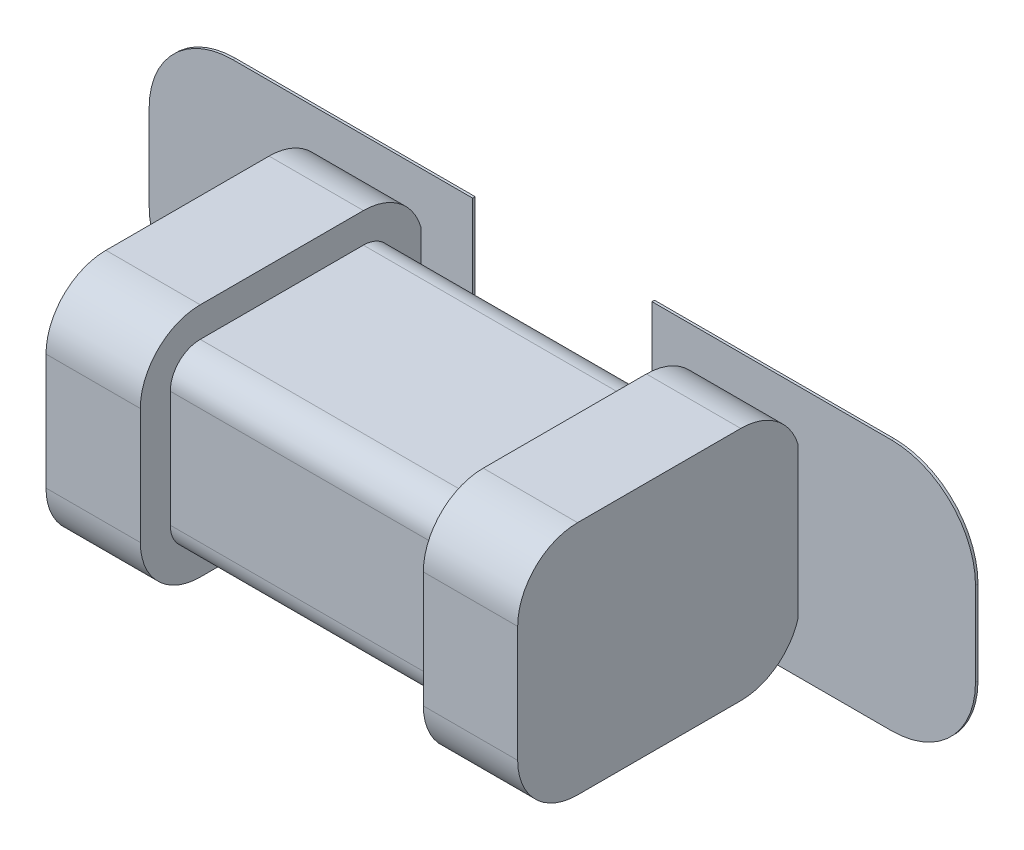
ISO-10303-21;
HEADER;
FILE_DESCRIPTION(('STEP AP214'),'2;1');
FILE_NAME('part.step','',(''),(''),'','','');
FILE_SCHEMA(('AUTOMOTIVE_DESIGN { 1 0 10303 214 1 1 1 1 }'));
ENDSEC;
DATA;
#1=APPLICATION_CONTEXT('core data for automotive mechanical design processes');
#2=APPLICATION_PROTOCOL_DEFINITION('international standard','automotive_design',2000,#1);
#3=PRODUCT_CONTEXT('',#1,'mechanical');
#4=PRODUCT('Part','Part','',(#3));
#5=PRODUCT_RELATED_PRODUCT_CATEGORY('part','',(#4));
#6=PRODUCT_DEFINITION_FORMATION('','',#4);
#7=PRODUCT_DEFINITION_CONTEXT('part definition',#1,'design');
#8=PRODUCT_DEFINITION('design','',#6,#7);
#9=PRODUCT_DEFINITION_SHAPE('','',#8);
#10=(LENGTH_UNIT() NAMED_UNIT(*) SI_UNIT(.MILLI.,.METRE.));
#11=(NAMED_UNIT(*) PLANE_ANGLE_UNIT() SI_UNIT($,.RADIAN.));
#12=(NAMED_UNIT(*) SI_UNIT($,.STERADIAN.) SOLID_ANGLE_UNIT());
#13=UNCERTAINTY_MEASURE_WITH_UNIT(LENGTH_MEASURE(1.E-05),#10,'distance_accuracy_value','');
#14=(GEOMETRIC_REPRESENTATION_CONTEXT(3) GLOBAL_UNCERTAINTY_ASSIGNED_CONTEXT((#13)) GLOBAL_UNIT_ASSIGNED_CONTEXT((#10,
#11,#12)) REPRESENTATION_CONTEXT('',''));
#15=CARTESIAN_POINT('',(0.,0.,0.));
#16=DIRECTION('',(0.,0.,1.));
#17=DIRECTION('',(1.,0.,0.));
#18=AXIS2_PLACEMENT_3D('',#15,#16,#17);
#19=CARTESIAN_POINT('',(0.,0.,0.0762));
#20=DIRECTION('',(0.,0.,1.));
#21=DIRECTION('',(1.,0.,0.));
#22=AXIS2_PLACEMENT_3D('',#19,#20,#21);
#23=PLANE('',#22);
#24=CARTESIAN_POINT('',(-0.698058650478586,-0.0890682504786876,0.0762));
#25=DIRECTION('',(0.,0.,1.));
#26=DIRECTION('',(1.,0.,0.));
#27=AXIS2_PLACEMENT_3D('',#24,#25,#26);
#28=CIRCLE('',#27,0.177936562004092);
#29=CARTESIAN_POINT('',(-0.875995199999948,-0.0890016,0.0762));
#30=VERTEX_POINT('',#29);
#31=CARTESIAN_POINT('',(-0.697992,-0.267004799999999,0.0762));
#32=VERTEX_POINT('',#31);
#33=EDGE_CURVE('E268',#30,#32,#28,.T.);
#34=ORIENTED_EDGE('',*,*,#33,.F.);
#35=DIRECTION('',(0.,1.,0.));
#36=VECTOR('',#35,1.);
#37=CARTESIAN_POINT('',(-0.8759952,0.0890016,0.0762));
#38=LINE('',#37,#36);
#39=CARTESIAN_POINT('',(-0.875995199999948,0.0890016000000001,0.0762));
#40=VERTEX_POINT('',#39);
#41=EDGE_CURVE('E262',#40,#30,#38,.F.);
#42=ORIENTED_EDGE('',*,*,#41,.F.);
#43=CARTESIAN_POINT('',(-0.698058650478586,0.0890682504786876,0.0762));
#44=DIRECTION('',(0.,0.,1.));
#45=DIRECTION('',(1.,0.,0.));
#46=AXIS2_PLACEMENT_3D('',#43,#44,#45);
#47=CIRCLE('',#46,0.177936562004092);
#48=CARTESIAN_POINT('',(-0.697992,0.267004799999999,0.0762));
#49=VERTEX_POINT('',#48);
#50=EDGE_CURVE('E19',#49,#40,#47,.T.);
#51=ORIENTED_EDGE('',*,*,#50,.F.);
#52=DIRECTION('',(1.,0.,0.));
#53=VECTOR('',#52,1.);
#54=CARTESIAN_POINT('',(-0.189992,0.2670048,0.0762));
#55=LINE('',#54,#53);
#56=CARTESIAN_POINT('',(-0.189992,0.2670048,0.0762));
#57=VERTEX_POINT('',#56);
#58=EDGE_CURVE('E245',#57,#49,#55,.F.);
#59=ORIENTED_EDGE('',*,*,#58,.F.);
#60=DIRECTION('',(0.,1.,0.));
#61=VECTOR('',#60,1.);
#62=CARTESIAN_POINT('',(-0.189992,-0.2670048,0.0762));
#63=LINE('',#62,#61);
#64=CARTESIAN_POINT('',(-0.189992,-0.2670048,0.0762));
#65=VERTEX_POINT('',#64);
#66=EDGE_CURVE('E408',#65,#57,#63,.T.);
#67=ORIENTED_EDGE('',*,*,#66,.F.);
#68=DIRECTION('',(1.,0.,0.));
#69=VECTOR('',#68,1.);
#70=CARTESIAN_POINT('',(-0.697992,-0.2670048,0.0762));
#71=LINE('',#70,#69);
#72=EDGE_CURVE('E395',#32,#65,#71,.T.);
#73=ORIENTED_EDGE('',*,*,#72,.F.);
#74=EDGE_LOOP('',(#34,#42,#51,#59,#67,#73));
#75=FACE_BOUND('',#74,.T.);
#76=ADVANCED_FACE('F16',(#75),#23,.F.);
#77=CARTESIAN_POINT('',(-0.189992,0.2670048,0.0762));
#78=DIRECTION('',(0.,1.,0.));
#79=DIRECTION('',(0.,0.,1.));
#80=AXIS2_PLACEMENT_3D('',#77,#78,#79);
#81=PLANE('',#80);
#82=DIRECTION('',(0.,0.,-1.));
#83=VECTOR('',#82,1.);
#84=CARTESIAN_POINT('',(-0.189992,0.2670048,0.0762));
#85=LINE('',#84,#83);
#86=CARTESIAN_POINT('',(-0.189992,0.2670048,0.081534));
#87=VERTEX_POINT('',#86);
#88=EDGE_CURVE('E399',#57,#87,#85,.F.);
#89=ORIENTED_EDGE('',*,*,#88,.F.);
#90=ORIENTED_EDGE('',*,*,#58,.T.);
#91=DIRECTION('',(0.,0.,1.));
#92=VECTOR('',#91,1.);
#93=CARTESIAN_POINT('',(-0.697992,0.267004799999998,0.0762));
#94=LINE('',#93,#92);
#95=CARTESIAN_POINT('',(-0.697992,0.267004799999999,0.081534));
#96=VERTEX_POINT('',#95);
#97=EDGE_CURVE('E256',#96,#49,#94,.F.);
#98=ORIENTED_EDGE('',*,*,#97,.F.);
#99=DIRECTION('',(1.,0.,0.));
#100=VECTOR('',#99,1.);
#101=CARTESIAN_POINT('',(0.,0.2670048,0.081534));
#102=LINE('',#101,#100);
#103=EDGE_CURVE('E390',#87,#96,#102,.F.);
#104=ORIENTED_EDGE('',*,*,#103,.F.);
#105=EDGE_LOOP('',(#89,#90,#98,#104));
#106=FACE_BOUND('',#105,.T.);
#107=ADVANCED_FACE('F457',(#106),#81,.T.);
#108=CARTESIAN_POINT('',(-0.698058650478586,0.0890682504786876,0.0762));
#109=DIRECTION('',(0.,0.,1.));
#110=DIRECTION('',(1.,0.,0.));
#111=AXIS2_PLACEMENT_3D('',#108,#109,#110);
#112=CYLINDRICAL_SURFACE('',#111,0.177936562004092);
#113=ORIENTED_EDGE('',*,*,#97,.T.);
#114=ORIENTED_EDGE('',*,*,#50,.T.);
#115=DIRECTION('',(0.,0.,1.));
#116=VECTOR('',#115,1.);
#117=CARTESIAN_POINT('',(-0.8759952,0.0890016,0.0762));
#118=LINE('',#117,#116);
#119=CARTESIAN_POINT('',(-0.875995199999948,0.0890016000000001,0.081534));
#120=VERTEX_POINT('',#119);
#121=EDGE_CURVE('E254',#120,#40,#118,.F.);
#122=ORIENTED_EDGE('',*,*,#121,.F.);
#123=CARTESIAN_POINT('',(-0.698058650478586,0.0890682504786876,0.081534));
#124=DIRECTION('',(0.,0.,1.));
#125=DIRECTION('',(1.,0.,0.));
#126=AXIS2_PLACEMENT_3D('',#123,#124,#125);
#127=CIRCLE('',#126,0.177936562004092);
#128=EDGE_CURVE('E389',#96,#120,#127,.T.);
#129=ORIENTED_EDGE('',*,*,#128,.F.);
#130=EDGE_LOOP('',(#113,#114,#122,#129));
#131=FACE_BOUND('',#130,.T.);
#132=ADVANCED_FACE('F252',(#131),#112,.T.);
#133=CARTESIAN_POINT('',(-0.8759952,0.0890016,0.0762));
#134=DIRECTION('',(-1.,0.,0.));
#135=DIRECTION('',(0.,0.,1.));
#136=AXIS2_PLACEMENT_3D('',#133,#134,#135);
#137=PLANE('',#136);
#138=ORIENTED_EDGE('',*,*,#121,.T.);
#139=ORIENTED_EDGE('',*,*,#41,.T.);
#140=DIRECTION('',(0.,0.,1.));
#141=VECTOR('',#140,1.);
#142=CARTESIAN_POINT('',(-0.875995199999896,-0.0890016,0.0762));
#143=LINE('',#142,#141);
#144=CARTESIAN_POINT('',(-0.875995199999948,-0.0890016,0.081534));
#145=VERTEX_POINT('',#144);
#146=EDGE_CURVE('E269',#145,#30,#143,.F.);
#147=ORIENTED_EDGE('',*,*,#146,.F.);
#148=DIRECTION('',(0.,1.,0.));
#149=VECTOR('',#148,1.);
#150=CARTESIAN_POINT('',(-0.8759952,0.,0.081534));
#151=LINE('',#150,#149);
#152=EDGE_CURVE('E264',#120,#145,#151,.F.);
#153=ORIENTED_EDGE('',*,*,#152,.F.);
#154=EDGE_LOOP('',(#138,#139,#147,#153));
#155=FACE_BOUND('',#154,.T.);
#156=ADVANCED_FACE('F260',(#155),#137,.T.);
#157=CARTESIAN_POINT('',(-0.698058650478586,-0.0890682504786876,0.0762));
#158=DIRECTION('',(0.,0.,1.));
#159=DIRECTION('',(1.,0.,0.));
#160=AXIS2_PLACEMENT_3D('',#157,#158,#159);
#161=CYLINDRICAL_SURFACE('',#160,0.177936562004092);
#162=ORIENTED_EDGE('',*,*,#146,.T.);
#163=ORIENTED_EDGE('',*,*,#33,.T.);
#164=DIRECTION('',(0.,0.,-1.));
#165=VECTOR('',#164,1.);
#166=CARTESIAN_POINT('',(-0.697992,-0.2670048,0.0762));
#167=LINE('',#166,#165);
#168=CARTESIAN_POINT('',(-0.697992,-0.267004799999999,0.081534));
#169=VERTEX_POINT('',#168);
#170=EDGE_CURVE('E391',#169,#32,#167,.T.);
#171=ORIENTED_EDGE('',*,*,#170,.F.);
#172=CARTESIAN_POINT('',(-0.698058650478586,-0.0890682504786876,0.081534));
#173=DIRECTION('',(0.,0.,1.));
#174=DIRECTION('',(1.,0.,0.));
#175=AXIS2_PLACEMENT_3D('',#172,#173,#174);
#176=CIRCLE('',#175,0.177936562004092);
#177=EDGE_CURVE('E386',#145,#169,#176,.T.);
#178=ORIENTED_EDGE('',*,*,#177,.F.);
#179=EDGE_LOOP('',(#162,#163,#171,#178));
#180=FACE_BOUND('',#179,.T.);
#181=ADVANCED_FACE('F458',(#180),#161,.T.);
#182=CARTESIAN_POINT('',(-0.697992,-0.2670048,0.0762));
#183=DIRECTION('',(0.,-1.,0.));
#184=DIRECTION('',(0.,0.,-1.));
#185=AXIS2_PLACEMENT_3D('',#182,#183,#184);
#186=PLANE('',#185);
#187=ORIENTED_EDGE('',*,*,#170,.T.);
#188=ORIENTED_EDGE('',*,*,#72,.T.);
#189=DIRECTION('',(0.,0.,-1.));
#190=VECTOR('',#189,1.);
#191=CARTESIAN_POINT('',(-0.189992,-0.2670048,0.0762));
#192=LINE('',#191,#190);
#193=CARTESIAN_POINT('',(-0.189992,-0.2670048,0.081534));
#194=VERTEX_POINT('',#193);
#195=EDGE_CURVE('E405',#194,#65,#192,.T.);
#196=ORIENTED_EDGE('',*,*,#195,.F.);
#197=DIRECTION('',(1.,0.,0.));
#198=VECTOR('',#197,1.);
#199=CARTESIAN_POINT('',(0.,-0.2670048,0.081534));
#200=LINE('',#199,#198);
#201=EDGE_CURVE('E388',#169,#194,#200,.T.);
#202=ORIENTED_EDGE('',*,*,#201,.F.);
#203=EDGE_LOOP('',(#187,#188,#196,#202));
#204=FACE_BOUND('',#203,.T.);
#205=ADVANCED_FACE('F455',(#204),#186,.T.);
#206=CARTESIAN_POINT('',(-0.189992,-0.2670048,0.0762));
#207=DIRECTION('',(1.,0.,0.));
#208=DIRECTION('',(0.,0.,-1.));
#209=AXIS2_PLACEMENT_3D('',#206,#207,#208);
#210=PLANE('',#209);
#211=ORIENTED_EDGE('',*,*,#195,.T.);
#212=ORIENTED_EDGE('',*,*,#66,.T.);
#213=ORIENTED_EDGE('',*,*,#88,.T.);
#214=DIRECTION('',(0.,1.,0.));
#215=VECTOR('',#214,1.);
#216=CARTESIAN_POINT('',(-0.189992,0.,0.081534));
#217=LINE('',#216,#215);
#218=EDGE_CURVE('E411',#194,#87,#217,.T.);
#219=ORIENTED_EDGE('',*,*,#218,.F.);
#220=EDGE_LOOP('',(#211,#212,#213,#219));
#221=FACE_BOUND('',#220,.T.);
#222=ADVANCED_FACE('F456',(#221),#210,.T.);
#223=CARTESIAN_POINT('',(-0.500000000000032,0.249999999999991,0.0762));
#224=DIRECTION('',(-1.,0.,0.));
#225=DIRECTION('',(0.,0.,1.));
#226=AXIS2_PLACEMENT_3D('',#223,#224,#225);
#227=PLANE('',#226);
#228=CARTESIAN_POINT('',(-0.500000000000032,0.122999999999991,0.2032));
#229=DIRECTION('',(1.,0.,0.));
#230=DIRECTION('',(0.,0.,-1.));
#231=AXIS2_PLACEMENT_3D('',#228,#229,#230);
#232=CIRCLE('',#231,0.127);
#233=CARTESIAN_POINT('',(-0.500000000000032,0.15941956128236,0.0815340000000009));
#234=VERTEX_POINT('',#233);
#235=CARTESIAN_POINT('',(-0.500000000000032,0.249999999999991,0.2032));
#236=VERTEX_POINT('',#235);
#237=EDGE_CURVE('E369',#234,#236,#232,.T.);
#238=ORIENTED_EDGE('',*,*,#237,.F.);
#239=DIRECTION('',(0.,1.,0.));
#240=VECTOR('',#239,1.);
#241=CARTESIAN_POINT('',(-0.500000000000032,0.,0.081534));
#242=LINE('',#241,#240);
#243=CARTESIAN_POINT('',(-0.500000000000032,-0.15941956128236,0.0815340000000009));
#244=VERTEX_POINT('',#243);
#245=EDGE_CURVE('E385',#244,#234,#242,.T.);
#246=ORIENTED_EDGE('',*,*,#245,.F.);
#247=CARTESIAN_POINT('',(-0.500000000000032,-0.122999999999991,0.2032));
#248=DIRECTION('',(1.,0.,0.));
#249=DIRECTION('',(0.,0.,-1.));
#250=AXIS2_PLACEMENT_3D('',#247,#248,#249);
#251=CIRCLE('',#250,0.127);
#252=CARTESIAN_POINT('',(-0.500000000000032,-0.249999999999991,0.2032));
#253=VERTEX_POINT('',#252);
#254=EDGE_CURVE('E382',#253,#244,#251,.T.);
#255=ORIENTED_EDGE('',*,*,#254,.F.);
#256=DIRECTION('',(0.,0.,-1.));
#257=VECTOR('',#256,1.);
#258=CARTESIAN_POINT('',(-0.500000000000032,-0.249999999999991,0.0762));
#259=LINE('',#258,#257);
#260=CARTESIAN_POINT('',(-0.500000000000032,-0.249999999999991,0.549148));
#261=VERTEX_POINT('',#260);
#262=EDGE_CURVE('E403',#261,#253,#259,.T.);
#263=ORIENTED_EDGE('',*,*,#262,.F.);
#264=CARTESIAN_POINT('',(-0.500000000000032,-0.122999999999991,0.549148));
#265=DIRECTION('',(1.,0.,0.));
#266=DIRECTION('',(0.,0.,-1.));
#267=AXIS2_PLACEMENT_3D('',#264,#265,#266);
#268=CIRCLE('',#267,0.127);
#269=CARTESIAN_POINT('',(-0.500000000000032,-0.122999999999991,0.676148));
#270=VERTEX_POINT('',#269);
#271=EDGE_CURVE('E378',#270,#261,#268,.T.);
#272=ORIENTED_EDGE('',*,*,#271,.F.);
#273=DIRECTION('',(0.,1.,0.));
#274=VECTOR('',#273,1.);
#275=CARTESIAN_POINT('',(-0.500000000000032,0.,0.676148));
#276=LINE('',#275,#274);
#277=CARTESIAN_POINT('',(-0.500000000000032,0.122999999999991,0.676148));
#278=VERTEX_POINT('',#277);
#279=EDGE_CURVE('E436',#278,#270,#276,.F.);
#280=ORIENTED_EDGE('',*,*,#279,.F.);
#281=CARTESIAN_POINT('',(-0.500000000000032,0.122999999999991,0.549148));
#282=DIRECTION('',(-1.,0.,0.));
#283=DIRECTION('',(0.,0.,1.));
#284=AXIS2_PLACEMENT_3D('',#281,#282,#283);
#285=CIRCLE('',#284,0.127);
#286=CARTESIAN_POINT('',(-0.500000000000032,0.249999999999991,0.549148));
#287=VERTEX_POINT('',#286);
#288=EDGE_CURVE('E373',#287,#278,#285,.F.);
#289=ORIENTED_EDGE('',*,*,#288,.F.);
#290=DIRECTION('',(0.,0.,1.));
#291=VECTOR('',#290,1.);
#292=CARTESIAN_POINT('',(-0.500000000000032,0.249999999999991,0.0762));
#293=LINE('',#292,#291);
#294=EDGE_CURVE('E376',#236,#287,#293,.T.);
#295=ORIENTED_EDGE('',*,*,#294,.F.);
#296=EDGE_LOOP('',(#238,#246,#255,#263,#272,#280,#289,#295));
#297=FACE_BOUND('',#296,.T.);
#298=ADVANCED_FACE('F603',(#297),#227,.T.);
#299=CARTESIAN_POINT('',(0.,0.,0.081534));
#300=DIRECTION('',(0.,0.,1.));
#301=DIRECTION('',(1.,0.,0.));
#302=AXIS2_PLACEMENT_3D('',#299,#300,#301);
#303=PLANE('',#302);
#304=DIRECTION('',(1.,0.,0.));
#305=VECTOR('',#304,1.);
#306=CARTESIAN_POINT('',(0.500000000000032,-0.159419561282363,0.0815340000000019));
#307=LINE('',#306,#305);
#308=CARTESIAN_POINT('',(-0.30000000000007,-0.15941956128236,0.0815340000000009));
#309=VERTEX_POINT('',#308);
#310=EDGE_CURVE('E384',#244,#309,#307,.T.);
#311=ORIENTED_EDGE('',*,*,#310,.F.);
#312=ORIENTED_EDGE('',*,*,#245,.T.);
#313=DIRECTION('',(1.,0.,0.));
#314=VECTOR('',#313,1.);
#315=CARTESIAN_POINT('',(0.500000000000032,0.159419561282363,0.0815340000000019));
#316=LINE('',#315,#314);
#317=CARTESIAN_POINT('',(-0.30000000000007,0.15941956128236,0.0815340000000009));
#318=VERTEX_POINT('',#317);
#319=EDGE_CURVE('E950',#318,#234,#316,.F.);
#320=ORIENTED_EDGE('',*,*,#319,.F.);
#321=DIRECTION('',(0.,1.,0.));
#322=VECTOR('',#321,1.);
#323=CARTESIAN_POINT('',(-0.30000000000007,0.249999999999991,0.081534));
#324=LINE('',#323,#322);
#325=EDGE_CURVE('E368',#318,#309,#324,.F.);
#326=ORIENTED_EDGE('',*,*,#325,.T.);
#327=EDGE_LOOP('',(#311,#312,#320,#326));
#328=FACE_BOUND('',#327,.T.);
#329=ORIENTED_EDGE('',*,*,#201,.T.);
#330=ORIENTED_EDGE('',*,*,#218,.T.);
#331=ORIENTED_EDGE('',*,*,#103,.T.);
#332=ORIENTED_EDGE('',*,*,#128,.T.);
#333=ORIENTED_EDGE('',*,*,#152,.T.);
#334=ORIENTED_EDGE('',*,*,#177,.T.);
#335=EDGE_LOOP('',(#329,#330,#331,#332,#333,#334));
#336=FACE_BOUND('',#335,.T.);
#337=ADVANCED_FACE('F452',(#328,#336),#303,.T.);
#338=CARTESIAN_POINT('',(0.500000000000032,-0.122999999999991,0.2032));
#339=DIRECTION('',(1.,0.,0.));
#340=DIRECTION('',(0.,0.,-1.));
#341=AXIS2_PLACEMENT_3D('',#338,#339,#340);
#342=CYLINDRICAL_SURFACE('',#341,0.127);
#343=ORIENTED_EDGE('',*,*,#254,.T.);
#344=ORIENTED_EDGE('',*,*,#310,.T.);
#345=CARTESIAN_POINT('',(-0.30000000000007,-0.122999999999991,0.2032));
#346=DIRECTION('',(1.,0.,0.));
#347=DIRECTION('',(0.,0.,-1.));
#348=AXIS2_PLACEMENT_3D('',#345,#346,#347);
#349=CIRCLE('',#348,0.127);
#350=CARTESIAN_POINT('',(-0.30000000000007,-0.249999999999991,0.2032));
#351=VERTEX_POINT('',#350);
#352=EDGE_CURVE('E365',#309,#351,#349,.F.);
#353=ORIENTED_EDGE('',*,*,#352,.T.);
#354=DIRECTION('',(1.,0.,0.));
#355=VECTOR('',#354,1.);
#356=CARTESIAN_POINT('',(-0.500000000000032,-0.249999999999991,0.2032));
#357=LINE('',#356,#355);
#358=EDGE_CURVE('E381',#253,#351,#357,.T.);
#359=ORIENTED_EDGE('',*,*,#358,.F.);
#360=EDGE_LOOP('',(#343,#344,#353,#359));
#361=FACE_BOUND('',#360,.T.);
#362=ADVANCED_FACE('F596',(#361),#342,.T.);
#363=CARTESIAN_POINT('',(-0.500000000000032,-0.249999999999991,0.0762));
#364=DIRECTION('',(0.,-1.,0.));
#365=DIRECTION('',(0.,0.,-1.));
#366=AXIS2_PLACEMENT_3D('',#363,#364,#365);
#367=PLANE('',#366);
#368=ORIENTED_EDGE('',*,*,#262,.T.);
#369=ORIENTED_EDGE('',*,*,#358,.T.);
#370=DIRECTION('',(0.,0.,1.));
#371=VECTOR('',#370,1.);
#372=CARTESIAN_POINT('',(-0.30000000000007,-0.249999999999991,0.0762));
#373=LINE('',#372,#371);
#374=CARTESIAN_POINT('',(-0.30000000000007,-0.249999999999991,0.549148));
#375=VERTEX_POINT('',#374);
#376=EDGE_CURVE('E364',#351,#375,#373,.T.);
#377=ORIENTED_EDGE('',*,*,#376,.T.);
#378=DIRECTION('',(1.,0.,0.));
#379=VECTOR('',#378,1.);
#380=CARTESIAN_POINT('',(-0.503692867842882,-0.249999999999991,0.549148));
#381=LINE('',#380,#379);
#382=EDGE_CURVE('E380',#261,#375,#381,.T.);
#383=ORIENTED_EDGE('',*,*,#382,.F.);
#384=EDGE_LOOP('',(#368,#369,#377,#383));
#385=FACE_BOUND('',#384,.T.);
#386=ADVANCED_FACE('F593',(#385),#367,.T.);
#387=CARTESIAN_POINT('',(-0.503692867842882,-0.122999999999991,0.549148));
#388=DIRECTION('',(1.,0.,0.));
#389=DIRECTION('',(0.,0.,-1.));
#390=AXIS2_PLACEMENT_3D('',#387,#388,#389);
#391=CYLINDRICAL_SURFACE('',#390,0.127);
#392=ORIENTED_EDGE('',*,*,#382,.T.);
#393=CARTESIAN_POINT('',(-0.30000000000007,-0.122999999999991,0.549148));
#394=DIRECTION('',(1.,0.,0.));
#395=DIRECTION('',(0.,0.,-1.));
#396=AXIS2_PLACEMENT_3D('',#393,#394,#395);
#397=CIRCLE('',#396,0.127);
#398=CARTESIAN_POINT('',(-0.30000000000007,-0.122999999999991,0.676148));
#399=VERTEX_POINT('',#398);
#400=EDGE_CURVE('E361',#375,#399,#397,.F.);
#401=ORIENTED_EDGE('',*,*,#400,.T.);
#402=DIRECTION('',(1.,0.,0.));
#403=VECTOR('',#402,1.);
#404=CARTESIAN_POINT('',(0.,-0.122999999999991,0.676148));
#405=LINE('',#404,#403);
#406=EDGE_CURVE('E437',#270,#399,#405,.T.);
#407=ORIENTED_EDGE('',*,*,#406,.F.);
#408=ORIENTED_EDGE('',*,*,#271,.T.);
#409=EDGE_LOOP('',(#392,#401,#407,#408));
#410=FACE_BOUND('',#409,.T.);
#411=ADVANCED_FACE('F590',(#410),#391,.T.);
#412=CARTESIAN_POINT('',(0.,0.,0.676148));
#413=DIRECTION('',(0.,0.,1.));
#414=DIRECTION('',(1.,0.,0.));
#415=AXIS2_PLACEMENT_3D('',#412,#413,#414);
#416=PLANE('',#415);
#417=DIRECTION('',(0.,1.,0.));
#418=VECTOR('',#417,1.);
#419=CARTESIAN_POINT('',(-0.30000000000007,0.249999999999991,0.676148));
#420=LINE('',#419,#418);
#421=CARTESIAN_POINT('',(-0.30000000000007,0.122999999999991,0.676148));
#422=VERTEX_POINT('',#421);
#423=EDGE_CURVE('E360',#399,#422,#420,.T.);
#424=ORIENTED_EDGE('',*,*,#423,.T.);
#425=DIRECTION('',(-1.,0.,0.));
#426=VECTOR('',#425,1.);
#427=CARTESIAN_POINT('',(0.503550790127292,0.122999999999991,0.676148));
#428=LINE('',#427,#426);
#429=EDGE_CURVE('E377',#278,#422,#428,.F.);
#430=ORIENTED_EDGE('',*,*,#429,.F.);
#431=ORIENTED_EDGE('',*,*,#279,.T.);
#432=ORIENTED_EDGE('',*,*,#406,.T.);
#433=EDGE_LOOP('',(#424,#430,#431,#432));
#434=FACE_BOUND('',#433,.T.);
#435=ADVANCED_FACE('F586',(#434),#416,.T.);
#436=CARTESIAN_POINT('',(0.503550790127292,0.122999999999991,0.549148));
#437=DIRECTION('',(-1.,0.,0.));
#438=DIRECTION('',(0.,0.,1.));
#439=AXIS2_PLACEMENT_3D('',#436,#437,#438);
#440=CYLINDRICAL_SURFACE('',#439,0.127);
#441=DIRECTION('',(1.,0.,0.));
#442=VECTOR('',#441,1.);
#443=CARTESIAN_POINT('',(0.500000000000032,0.249999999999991,0.549148));
#444=LINE('',#443,#442);
#445=CARTESIAN_POINT('',(-0.30000000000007,0.249999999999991,0.549148));
#446=VERTEX_POINT('',#445);
#447=EDGE_CURVE('E372',#287,#446,#444,.T.);
#448=ORIENTED_EDGE('',*,*,#447,.F.);
#449=ORIENTED_EDGE('',*,*,#288,.T.);
#450=ORIENTED_EDGE('',*,*,#429,.T.);
#451=CARTESIAN_POINT('',(-0.30000000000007,0.122999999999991,0.549148));
#452=DIRECTION('',(-1.,0.,0.));
#453=DIRECTION('',(0.,0.,1.));
#454=AXIS2_PLACEMENT_3D('',#451,#452,#453);
#455=CIRCLE('',#454,0.127);
#456=EDGE_CURVE('E357',#422,#446,#455,.T.);
#457=ORIENTED_EDGE('',*,*,#456,.T.);
#458=EDGE_LOOP('',(#448,#449,#450,#457));
#459=FACE_BOUND('',#458,.T.);
#460=ADVANCED_FACE('F582',(#459),#440,.T.);
#461=CARTESIAN_POINT('',(0.500000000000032,0.249999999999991,0.0762));
#462=DIRECTION('',(0.,1.,0.));
#463=DIRECTION('',(0.,0.,1.));
#464=AXIS2_PLACEMENT_3D('',#461,#462,#463);
#465=PLANE('',#464);
#466=DIRECTION('',(0.,0.,1.));
#467=VECTOR('',#466,1.);
#468=CARTESIAN_POINT('',(-0.30000000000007,0.249999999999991,0.0762));
#469=LINE('',#468,#467);
#470=CARTESIAN_POINT('',(-0.30000000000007,0.249999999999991,0.2032));
#471=VERTEX_POINT('',#470);
#472=EDGE_CURVE('E356',#446,#471,#469,.F.);
#473=ORIENTED_EDGE('',*,*,#472,.T.);
#474=DIRECTION('',(1.,0.,0.));
#475=VECTOR('',#474,1.);
#476=CARTESIAN_POINT('',(0.500000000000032,0.249999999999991,0.2032));
#477=LINE('',#476,#475);
#478=EDGE_CURVE('E371',#236,#471,#477,.T.);
#479=ORIENTED_EDGE('',*,*,#478,.F.);
#480=ORIENTED_EDGE('',*,*,#294,.T.);
#481=ORIENTED_EDGE('',*,*,#447,.T.);
#482=EDGE_LOOP('',(#473,#479,#480,#481));
#483=FACE_BOUND('',#482,.T.);
#484=ADVANCED_FACE('F578',(#483),#465,.T.);
#485=CARTESIAN_POINT('',(0.500000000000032,0.122999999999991,0.2032));
#486=DIRECTION('',(1.,0.,0.));
#487=DIRECTION('',(0.,0.,-1.));
#488=AXIS2_PLACEMENT_3D('',#485,#486,#487);
#489=CYLINDRICAL_SURFACE('',#488,0.127);
#490=CARTESIAN_POINT('',(-0.30000000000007,0.122999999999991,0.2032));
#491=DIRECTION('',(1.,0.,0.));
#492=DIRECTION('',(0.,0.,-1.));
#493=AXIS2_PLACEMENT_3D('',#490,#491,#492);
#494=CIRCLE('',#493,0.127);
#495=EDGE_CURVE('E353',#471,#318,#494,.F.);
#496=ORIENTED_EDGE('',*,*,#495,.T.);
#497=ORIENTED_EDGE('',*,*,#319,.T.);
#498=ORIENTED_EDGE('',*,*,#237,.T.);
#499=ORIENTED_EDGE('',*,*,#478,.T.);
#500=EDGE_LOOP('',(#496,#497,#498,#499));
#501=FACE_BOUND('',#500,.T.);
#502=ADVANCED_FACE('F574',(#501),#489,.T.);
#503=CARTESIAN_POINT('',(-0.30000000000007,0.249999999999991,0.0762));
#504=DIRECTION('',(-1.,0.,0.));
#505=DIRECTION('',(0.,0.,1.));
#506=AXIS2_PLACEMENT_3D('',#503,#504,#505);
#507=PLANE('',#506);
#508=DIRECTION('',(0.,1.,0.));
#509=VECTOR('',#508,1.);
#510=CARTESIAN_POINT('',(-0.30000000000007,0.249999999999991,0.1397));
#511=LINE('',#510,#509);
#512=CARTESIAN_POINT('',(-0.30000000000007,0.122999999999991,0.1397));
#513=VERTEX_POINT('',#512);
#514=CARTESIAN_POINT('',(-0.30000000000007,-0.122999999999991,0.1397));
#515=VERTEX_POINT('',#514);
#516=EDGE_CURVE('E344',#513,#515,#511,.F.);
#517=ORIENTED_EDGE('',*,*,#516,.T.);
#518=CARTESIAN_POINT('',(-0.30000000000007,-0.122999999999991,0.2032));
#519=DIRECTION('',(1.,0.,0.));
#520=DIRECTION('',(0.,0.,-1.));
#521=AXIS2_PLACEMENT_3D('',#518,#519,#520);
#522=CIRCLE('',#521,0.0635);
#523=CARTESIAN_POINT('',(-0.30000000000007,-0.186499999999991,0.2032));
#524=VERTEX_POINT('',#523);
#525=EDGE_CURVE('E341',#524,#515,#522,.T.);
#526=ORIENTED_EDGE('',*,*,#525,.F.);
#527=DIRECTION('',(0.,0.,1.));
#528=VECTOR('',#527,1.);
#529=CARTESIAN_POINT('',(-0.30000000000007,-0.186499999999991,0.0762));
#530=LINE('',#529,#528);
#531=CARTESIAN_POINT('',(-0.30000000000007,-0.186499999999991,0.549148));
#532=VERTEX_POINT('',#531);
#533=EDGE_CURVE('E340',#524,#532,#530,.T.);
#534=ORIENTED_EDGE('',*,*,#533,.T.);
#535=CARTESIAN_POINT('',(-0.30000000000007,-0.122999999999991,0.549148));
#536=DIRECTION('',(-1.,0.,0.));
#537=DIRECTION('',(0.,0.,1.));
#538=AXIS2_PLACEMENT_3D('',#535,#536,#537);
#539=CIRCLE('',#538,0.0635);
#540=CARTESIAN_POINT('',(-0.30000000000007,-0.122999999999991,0.612648));
#541=VERTEX_POINT('',#540);
#542=EDGE_CURVE('E337',#541,#532,#539,.F.);
#543=ORIENTED_EDGE('',*,*,#542,.F.);
#544=DIRECTION('',(0.,1.,0.));
#545=VECTOR('',#544,1.);
#546=CARTESIAN_POINT('',(-0.30000000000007,0.249999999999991,0.612648));
#547=LINE('',#546,#545);
#548=CARTESIAN_POINT('',(-0.30000000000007,0.122999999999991,0.612648));
#549=VERTEX_POINT('',#548);
#550=EDGE_CURVE('E352',#541,#549,#547,.T.);
#551=ORIENTED_EDGE('',*,*,#550,.T.);
#552=CARTESIAN_POINT('',(-0.30000000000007,0.122999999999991,0.549148));
#553=DIRECTION('',(1.,0.,0.));
#554=DIRECTION('',(0.,0.,-1.));
#555=AXIS2_PLACEMENT_3D('',#552,#553,#554);
#556=CIRCLE('',#555,0.0635);
#557=CARTESIAN_POINT('',(-0.30000000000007,0.186499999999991,0.549148));
#558=VERTEX_POINT('',#557);
#559=EDGE_CURVE('E349',#558,#549,#556,.T.);
#560=ORIENTED_EDGE('',*,*,#559,.F.);
#561=DIRECTION('',(0.,0.,-1.));
#562=VECTOR('',#561,1.);
#563=CARTESIAN_POINT('',(-0.30000000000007,0.186499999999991,0.0762));
#564=LINE('',#563,#562);
#565=CARTESIAN_POINT('',(-0.30000000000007,0.186499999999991,0.2032));
#566=VERTEX_POINT('',#565);
#567=EDGE_CURVE('E348',#558,#566,#564,.T.);
#568=ORIENTED_EDGE('',*,*,#567,.T.);
#569=CARTESIAN_POINT('',(-0.30000000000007,0.122999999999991,0.2032));
#570=DIRECTION('',(-1.,0.,0.));
#571=DIRECTION('',(0.,0.,1.));
#572=AXIS2_PLACEMENT_3D('',#569,#570,#571);
#573=CIRCLE('',#572,0.0635);
#574=EDGE_CURVE('E345',#513,#566,#573,.F.);
#575=ORIENTED_EDGE('',*,*,#574,.F.);
#576=EDGE_LOOP('',(#517,#526,#534,#543,#551,#560,#568,#575));
#577=FACE_BOUND('',#576,.T.);
#578=ORIENTED_EDGE('',*,*,#472,.F.);
#579=ORIENTED_EDGE('',*,*,#456,.F.);
#580=ORIENTED_EDGE('',*,*,#423,.F.);
#581=ORIENTED_EDGE('',*,*,#400,.F.);
#582=ORIENTED_EDGE('',*,*,#376,.F.);
#583=ORIENTED_EDGE('',*,*,#352,.F.);
#584=ORIENTED_EDGE('',*,*,#325,.F.);
#585=ORIENTED_EDGE('',*,*,#495,.F.);
#586=EDGE_LOOP('',(#578,#579,#580,#581,#582,#583,#584,#585));
#587=FACE_BOUND('',#586,.T.);
#588=ADVANCED_FACE('F570',(#577,#587),#507,.F.);
#589=CARTESIAN_POINT('',(0.30000000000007,0.249999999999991,0.612648));
#590=DIRECTION('',(0.,0.,-1.));
#591=DIRECTION('',(-1.,0.,0.));
#592=AXIS2_PLACEMENT_3D('',#589,#590,#591);
#593=PLANE('',#592);
#594=DIRECTION('',(-1.,0.,0.));
#595=VECTOR('',#594,1.);
#596=CARTESIAN_POINT('',(0.30369286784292,-0.122999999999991,0.612648));
#597=LINE('',#596,#595);
#598=CARTESIAN_POINT('',(0.30000000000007,-0.122999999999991,0.612648));
#599=VERTEX_POINT('',#598);
#600=EDGE_CURVE('E993',#599,#541,#597,.T.);
#601=ORIENTED_EDGE('',*,*,#600,.F.);
#602=DIRECTION('',(0.,1.,0.));
#603=VECTOR('',#602,1.);
#604=CARTESIAN_POINT('',(0.30000000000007,0.186499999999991,0.612648));
#605=LINE('',#604,#603);
#606=CARTESIAN_POINT('',(0.30000000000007,0.122999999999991,0.612648));
#607=VERTEX_POINT('',#606);
#608=EDGE_CURVE('E324',#599,#607,#605,.T.);
#609=ORIENTED_EDGE('',*,*,#608,.T.);
#610=DIRECTION('',(1.,0.,0.));
#611=VECTOR('',#610,1.);
#612=CARTESIAN_POINT('',(-0.303870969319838,0.122999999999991,0.612648));
#613=LINE('',#612,#611);
#614=EDGE_CURVE('E351',#549,#607,#613,.T.);
#615=ORIENTED_EDGE('',*,*,#614,.F.);
#616=ORIENTED_EDGE('',*,*,#550,.F.);
#617=EDGE_LOOP('',(#601,#609,#615,#616));
#618=FACE_BOUND('',#617,.T.);
#619=ADVANCED_FACE('F566',(#618),#593,.F.);
#620=CARTESIAN_POINT('',(-0.303870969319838,0.122999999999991,0.549148));
#621=DIRECTION('',(1.,0.,0.));
#622=DIRECTION('',(0.,0.,-1.));
#623=AXIS2_PLACEMENT_3D('',#620,#621,#622);
#624=CYLINDRICAL_SURFACE('',#623,0.0635);
#625=ORIENTED_EDGE('',*,*,#559,.T.);
#626=ORIENTED_EDGE('',*,*,#614,.T.);
#627=CARTESIAN_POINT('',(0.30000000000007,0.122999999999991,0.549148));
#628=DIRECTION('',(1.,0.,0.));
#629=DIRECTION('',(0.,0.,-1.));
#630=AXIS2_PLACEMENT_3D('',#627,#628,#629);
#631=CIRCLE('',#630,0.0635);
#632=CARTESIAN_POINT('',(0.30000000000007,0.186499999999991,0.549148));
#633=VERTEX_POINT('',#632);
#634=EDGE_CURVE('E321',#607,#633,#631,.F.);
#635=ORIENTED_EDGE('',*,*,#634,.T.);
#636=DIRECTION('',(1.,0.,0.));
#637=VECTOR('',#636,1.);
#638=CARTESIAN_POINT('',(-0.30000000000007,0.186499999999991,0.549148));
#639=LINE('',#638,#637);
#640=EDGE_CURVE('E974',#633,#558,#639,.F.);
#641=ORIENTED_EDGE('',*,*,#640,.T.);
#642=EDGE_LOOP('',(#625,#626,#635,#641));
#643=FACE_BOUND('',#642,.T.);
#644=ADVANCED_FACE('F562',(#643),#624,.T.);
#645=CARTESIAN_POINT('',(-0.30000000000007,0.186499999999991,0.0762));
#646=DIRECTION('',(0.,-1.,0.));
#647=DIRECTION('',(0.,0.,-1.));
#648=AXIS2_PLACEMENT_3D('',#645,#646,#647);
#649=PLANE('',#648);
#650=ORIENTED_EDGE('',*,*,#640,.F.);
#651=DIRECTION('',(0.,0.,-1.));
#652=VECTOR('',#651,1.);
#653=CARTESIAN_POINT('',(0.30000000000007,0.186499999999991,0.0762));
#654=LINE('',#653,#652);
#655=CARTESIAN_POINT('',(0.30000000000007,0.186499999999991,0.2032));
#656=VERTEX_POINT('',#655);
#657=EDGE_CURVE('E320',#633,#656,#654,.T.);
#658=ORIENTED_EDGE('',*,*,#657,.T.);
#659=DIRECTION('',(-1.,0.,0.));
#660=VECTOR('',#659,1.);
#661=CARTESIAN_POINT('',(0.30355079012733,0.186499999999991,0.2032));
#662=LINE('',#661,#660);
#663=EDGE_CURVE('E347',#566,#656,#662,.F.);
#664=ORIENTED_EDGE('',*,*,#663,.F.);
#665=ORIENTED_EDGE('',*,*,#567,.F.);
#666=EDGE_LOOP('',(#650,#658,#664,#665));
#667=FACE_BOUND('',#666,.T.);
#668=ADVANCED_FACE('F558',(#667),#649,.F.);
#669=CARTESIAN_POINT('',(0.30355079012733,0.122999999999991,0.2032));
#670=DIRECTION('',(-1.,0.,0.));
#671=DIRECTION('',(0.,0.,1.));
#672=AXIS2_PLACEMENT_3D('',#669,#670,#671);
#673=CYLINDRICAL_SURFACE('',#672,0.0635);
#674=CARTESIAN_POINT('',(0.30000000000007,0.122999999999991,0.2032));
#675=DIRECTION('',(-1.,0.,0.));
#676=DIRECTION('',(0.,0.,1.));
#677=AXIS2_PLACEMENT_3D('',#674,#675,#676);
#678=CIRCLE('',#677,0.0635);
#679=CARTESIAN_POINT('',(0.30000000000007,0.122999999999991,0.1397));
#680=VERTEX_POINT('',#679);
#681=EDGE_CURVE('E317',#656,#680,#678,.T.);
#682=ORIENTED_EDGE('',*,*,#681,.T.);
#683=DIRECTION('',(1.,0.,0.));
#684=VECTOR('',#683,1.);
#685=CARTESIAN_POINT('',(-0.30000000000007,0.122999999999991,0.1397));
#686=LINE('',#685,#684);
#687=EDGE_CURVE('E972',#680,#513,#686,.F.);
#688=ORIENTED_EDGE('',*,*,#687,.T.);
#689=ORIENTED_EDGE('',*,*,#574,.T.);
#690=ORIENTED_EDGE('',*,*,#663,.T.);
#691=EDGE_LOOP('',(#682,#688,#689,#690));
#692=FACE_BOUND('',#691,.T.);
#693=ADVANCED_FACE('F554',(#692),#673,.T.);
#694=CARTESIAN_POINT('',(-0.30000000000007,0.249999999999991,0.1397));
#695=DIRECTION('',(0.,0.,1.));
#696=DIRECTION('',(1.,0.,0.));
#697=AXIS2_PLACEMENT_3D('',#694,#695,#696);
#698=PLANE('',#697);
#699=DIRECTION('',(1.,0.,0.));
#700=VECTOR('',#699,1.);
#701=CARTESIAN_POINT('',(-0.30355079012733,-0.122999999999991,0.1397));
#702=LINE('',#701,#700);
#703=CARTESIAN_POINT('',(0.30000000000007,-0.122999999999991,0.1397));
#704=VERTEX_POINT('',#703);
#705=EDGE_CURVE('E343',#515,#704,#702,.T.);
#706=ORIENTED_EDGE('',*,*,#705,.F.);
#707=ORIENTED_EDGE('',*,*,#516,.F.);
#708=ORIENTED_EDGE('',*,*,#687,.F.);
#709=DIRECTION('',(0.,1.,0.));
#710=VECTOR('',#709,1.);
#711=CARTESIAN_POINT('',(0.30000000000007,0.186499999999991,0.1397));
#712=LINE('',#711,#710);
#713=EDGE_CURVE('E316',#680,#704,#712,.F.);
#714=ORIENTED_EDGE('',*,*,#713,.T.);
#715=EDGE_LOOP('',(#706,#707,#708,#714));
#716=FACE_BOUND('',#715,.T.);
#717=ADVANCED_FACE('F550',(#716),#698,.F.);
#718=CARTESIAN_POINT('',(-0.30355079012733,-0.122999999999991,0.2032));
#719=DIRECTION('',(1.,0.,0.));
#720=DIRECTION('',(0.,0.,-1.));
#721=AXIS2_PLACEMENT_3D('',#718,#719,#720);
#722=CYLINDRICAL_SURFACE('',#721,0.0635);
#723=ORIENTED_EDGE('',*,*,#525,.T.);
#724=ORIENTED_EDGE('',*,*,#705,.T.);
#725=CARTESIAN_POINT('',(0.30000000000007,-0.122999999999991,0.2032));
#726=DIRECTION('',(1.,0.,0.));
#727=DIRECTION('',(0.,0.,-1.));
#728=AXIS2_PLACEMENT_3D('',#725,#726,#727);
#729=CIRCLE('',#728,0.0635);
#730=CARTESIAN_POINT('',(0.30000000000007,-0.186499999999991,0.2032));
#731=VERTEX_POINT('',#730);
#732=EDGE_CURVE('E313',#704,#731,#729,.F.);
#733=ORIENTED_EDGE('',*,*,#732,.T.);
#734=DIRECTION('',(1.,0.,0.));
#735=VECTOR('',#734,1.);
#736=CARTESIAN_POINT('',(0.30000000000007,-0.186499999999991,0.2032));
#737=LINE('',#736,#735);
#738=EDGE_CURVE('E985',#731,#524,#737,.F.);
#739=ORIENTED_EDGE('',*,*,#738,.T.);
#740=EDGE_LOOP('',(#723,#724,#733,#739));
#741=FACE_BOUND('',#740,.T.);
#742=ADVANCED_FACE('F546',(#741),#722,.T.);
#743=CARTESIAN_POINT('',(0.30000000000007,-0.186499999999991,0.0762));
#744=DIRECTION('',(0.,1.,0.));
#745=DIRECTION('',(0.,0.,1.));
#746=AXIS2_PLACEMENT_3D('',#743,#744,#745);
#747=PLANE('',#746);
#748=ORIENTED_EDGE('',*,*,#738,.F.);
#749=DIRECTION('',(0.,0.,-1.));
#750=VECTOR('',#749,1.);
#751=CARTESIAN_POINT('',(0.30000000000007,-0.186499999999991,0.0762));
#752=LINE('',#751,#750);
#753=CARTESIAN_POINT('',(0.30000000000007,-0.186499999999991,0.549148));
#754=VERTEX_POINT('',#753);
#755=EDGE_CURVE('E312',#731,#754,#752,.F.);
#756=ORIENTED_EDGE('',*,*,#755,.T.);
#757=DIRECTION('',(-1.,0.,0.));
#758=VECTOR('',#757,1.);
#759=CARTESIAN_POINT('',(0.30369286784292,-0.186499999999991,0.549148));
#760=LINE('',#759,#758);
#761=EDGE_CURVE('E339',#532,#754,#760,.F.);
#762=ORIENTED_EDGE('',*,*,#761,.F.);
#763=ORIENTED_EDGE('',*,*,#533,.F.);
#764=EDGE_LOOP('',(#748,#756,#762,#763));
#765=FACE_BOUND('',#764,.T.);
#766=ADVANCED_FACE('F542',(#765),#747,.F.);
#767=CARTESIAN_POINT('',(0.30369286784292,-0.122999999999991,0.549148));
#768=DIRECTION('',(-1.,0.,0.));
#769=DIRECTION('',(0.,0.,1.));
#770=AXIS2_PLACEMENT_3D('',#767,#768,#769);
#771=CYLINDRICAL_SURFACE('',#770,0.0635);
#772=CARTESIAN_POINT('',(0.30000000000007,-0.122999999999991,0.549148));
#773=DIRECTION('',(-1.,0.,0.));
#774=DIRECTION('',(0.,0.,1.));
#775=AXIS2_PLACEMENT_3D('',#772,#773,#774);
#776=CIRCLE('',#775,0.0635);
#777=EDGE_CURVE('E309',#754,#599,#776,.T.);
#778=ORIENTED_EDGE('',*,*,#777,.T.);
#779=ORIENTED_EDGE('',*,*,#600,.T.);
#780=ORIENTED_EDGE('',*,*,#542,.T.);
#781=ORIENTED_EDGE('',*,*,#761,.T.);
#782=EDGE_LOOP('',(#778,#779,#780,#781));
#783=FACE_BOUND('',#782,.T.);
#784=ADVANCED_FACE('F538',(#783),#771,.T.);
#785=CARTESIAN_POINT('',(0.500000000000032,0.249999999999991,0.0762));
#786=DIRECTION('',(0.,1.,0.));
#787=DIRECTION('',(0.,0.,1.));
#788=AXIS2_PLACEMENT_3D('',#785,#786,#787);
#789=PLANE('',#788);
#790=DIRECTION('',(0.,0.,-1.));
#791=VECTOR('',#790,1.);
#792=CARTESIAN_POINT('',(0.500000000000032,0.249999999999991,0.0762));
#793=LINE('',#792,#791);
#794=CARTESIAN_POINT('',(0.500000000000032,0.249999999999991,0.2032));
#795=VERTEX_POINT('',#794);
#796=CARTESIAN_POINT('',(0.500000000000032,0.249999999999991,0.549148));
#797=VERTEX_POINT('',#796);
#798=EDGE_CURVE('E301',#795,#797,#793,.F.);
#799=ORIENTED_EDGE('',*,*,#798,.F.);
#800=DIRECTION('',(1.,0.,0.));
#801=VECTOR('',#800,1.);
#802=CARTESIAN_POINT('',(0.500000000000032,0.249999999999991,0.2032));
#803=LINE('',#802,#801);
#804=CARTESIAN_POINT('',(0.30000000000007,0.249999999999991,0.2032));
#805=VERTEX_POINT('',#804);
#806=EDGE_CURVE('E305',#805,#795,#803,.T.);
#807=ORIENTED_EDGE('',*,*,#806,.F.);
#808=DIRECTION('',(0.,0.,-1.));
#809=VECTOR('',#808,1.);
#810=CARTESIAN_POINT('',(0.30000000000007,0.249999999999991,0.0762));
#811=LINE('',#810,#809);
#812=CARTESIAN_POINT('',(0.30000000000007,0.249999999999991,0.549148));
#813=VERTEX_POINT('',#812);
#814=EDGE_CURVE('E336',#805,#813,#811,.F.);
#815=ORIENTED_EDGE('',*,*,#814,.T.);
#816=DIRECTION('',(-1.,0.,0.));
#817=VECTOR('',#816,1.);
#818=CARTESIAN_POINT('',(0.503550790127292,0.249999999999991,0.549148));
#819=LINE('',#818,#817);
#820=EDGE_CURVE('E1025',#797,#813,#819,.T.);
#821=ORIENTED_EDGE('',*,*,#820,.F.);
#822=EDGE_LOOP('',(#799,#807,#815,#821));
#823=FACE_BOUND('',#822,.T.);
#824=ADVANCED_FACE('F534',(#823),#789,.T.);
#825=CARTESIAN_POINT('',(0.503550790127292,0.122999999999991,0.549148));
#826=DIRECTION('',(-1.,0.,0.));
#827=DIRECTION('',(0.,0.,1.));
#828=AXIS2_PLACEMENT_3D('',#825,#826,#827);
#829=CYLINDRICAL_SURFACE('',#828,0.127);
#830=ORIENTED_EDGE('',*,*,#820,.T.);
#831=CARTESIAN_POINT('',(0.30000000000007,0.122999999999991,0.549148));
#832=DIRECTION('',(-1.,0.,0.));
#833=DIRECTION('',(0.,0.,1.));
#834=AXIS2_PLACEMENT_3D('',#831,#832,#833);
#835=CIRCLE('',#834,0.127);
#836=CARTESIAN_POINT('',(0.30000000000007,0.122999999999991,0.676148));
#837=VERTEX_POINT('',#836);
#838=EDGE_CURVE('E333',#813,#837,#835,.F.);
#839=ORIENTED_EDGE('',*,*,#838,.T.);
#840=DIRECTION('',(1.,0.,0.));
#841=VECTOR('',#840,1.);
#842=CARTESIAN_POINT('',(0.,0.122999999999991,0.676148));
#843=LINE('',#842,#841);
#844=CARTESIAN_POINT('',(0.500000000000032,0.122999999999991,0.676148));
#845=VERTEX_POINT('',#844);
#846=EDGE_CURVE('E1023',#845,#837,#843,.F.);
#847=ORIENTED_EDGE('',*,*,#846,.F.);
#848=CARTESIAN_POINT('',(0.500000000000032,0.122999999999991,0.549148));
#849=DIRECTION('',(-1.,0.,0.));
#850=DIRECTION('',(0.,0.,1.));
#851=AXIS2_PLACEMENT_3D('',#848,#849,#850);
#852=CIRCLE('',#851,0.127);
#853=EDGE_CURVE('E299',#797,#845,#852,.F.);
#854=ORIENTED_EDGE('',*,*,#853,.F.);
#855=EDGE_LOOP('',(#830,#839,#847,#854));
#856=FACE_BOUND('',#855,.T.);
#857=ADVANCED_FACE('F530',(#856),#829,.T.);
#858=CARTESIAN_POINT('',(0.,0.,0.676148));
#859=DIRECTION('',(0.,0.,1.));
#860=DIRECTION('',(1.,0.,0.));
#861=AXIS2_PLACEMENT_3D('',#858,#859,#860);
#862=PLANE('',#861);
#863=DIRECTION('',(0.,1.,0.));
#864=VECTOR('',#863,1.);
#865=CARTESIAN_POINT('',(0.500000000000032,-0.249999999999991,0.676148));
#866=LINE('',#865,#864);
#867=CARTESIAN_POINT('',(0.500000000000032,-0.122999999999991,0.676148));
#868=VERTEX_POINT('',#867);
#869=EDGE_CURVE('E298',#845,#868,#866,.F.);
#870=ORIENTED_EDGE('',*,*,#869,.F.);
#871=ORIENTED_EDGE('',*,*,#846,.T.);
#872=DIRECTION('',(0.,1.,0.));
#873=VECTOR('',#872,1.);
#874=CARTESIAN_POINT('',(0.30000000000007,0.186499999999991,0.676148));
#875=LINE('',#874,#873);
#876=CARTESIAN_POINT('',(0.30000000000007,-0.122999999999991,0.676148));
#877=VERTEX_POINT('',#876);
#878=EDGE_CURVE('E332',#837,#877,#875,.F.);
#879=ORIENTED_EDGE('',*,*,#878,.T.);
#880=DIRECTION('',(1.,0.,0.));
#881=VECTOR('',#880,1.);
#882=CARTESIAN_POINT('',(-0.503692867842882,-0.122999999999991,0.676148));
#883=LINE('',#882,#881);
#884=EDGE_CURVE('E1021',#868,#877,#883,.F.);
#885=ORIENTED_EDGE('',*,*,#884,.F.);
#886=EDGE_LOOP('',(#870,#871,#879,#885));
#887=FACE_BOUND('',#886,.T.);
#888=ADVANCED_FACE('F526',(#887),#862,.T.);
#889=CARTESIAN_POINT('',(-0.503692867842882,-0.122999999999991,0.549148));
#890=DIRECTION('',(1.,0.,0.));
#891=DIRECTION('',(0.,0.,-1.));
#892=AXIS2_PLACEMENT_3D('',#889,#890,#891);
#893=CYLINDRICAL_SURFACE('',#892,0.127);
#894=DIRECTION('',(1.,0.,0.));
#895=VECTOR('',#894,1.);
#896=CARTESIAN_POINT('',(-0.500000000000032,-0.249999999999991,0.549148));
#897=LINE('',#896,#895);
#898=CARTESIAN_POINT('',(0.500000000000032,-0.249999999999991,0.549148));
#899=VERTEX_POINT('',#898);
#900=CARTESIAN_POINT('',(0.30000000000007,-0.249999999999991,0.549148));
#901=VERTEX_POINT('',#900);
#902=EDGE_CURVE('E1019',#899,#901,#897,.F.);
#903=ORIENTED_EDGE('',*,*,#902,.F.);
#904=CARTESIAN_POINT('',(0.500000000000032,-0.122999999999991,0.549148));
#905=DIRECTION('',(1.,0.,0.));
#906=DIRECTION('',(0.,0.,-1.));
#907=AXIS2_PLACEMENT_3D('',#904,#905,#906);
#908=CIRCLE('',#907,0.127);
#909=EDGE_CURVE('E296',#868,#899,#908,.T.);
#910=ORIENTED_EDGE('',*,*,#909,.F.);
#911=ORIENTED_EDGE('',*,*,#884,.T.);
#912=CARTESIAN_POINT('',(0.30000000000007,-0.122999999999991,0.549148));
#913=DIRECTION('',(1.,0.,0.));
#914=DIRECTION('',(0.,0.,-1.));
#915=AXIS2_PLACEMENT_3D('',#912,#913,#914);
#916=CIRCLE('',#915,0.127);
#917=EDGE_CURVE('E329',#877,#901,#916,.T.);
#918=ORIENTED_EDGE('',*,*,#917,.T.);
#919=EDGE_LOOP('',(#903,#910,#911,#918));
#920=FACE_BOUND('',#919,.T.);
#921=ADVANCED_FACE('F522',(#920),#893,.T.);
#922=CARTESIAN_POINT('',(-0.500000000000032,-0.249999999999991,0.0762));
#923=DIRECTION('',(0.,-1.,0.));
#924=DIRECTION('',(0.,0.,-1.));
#925=AXIS2_PLACEMENT_3D('',#922,#923,#924);
#926=PLANE('',#925);
#927=DIRECTION('',(0.,0.,-1.));
#928=VECTOR('',#927,1.);
#929=CARTESIAN_POINT('',(0.30000000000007,-0.249999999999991,0.0762));
#930=LINE('',#929,#928);
#931=CARTESIAN_POINT('',(0.30000000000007,-0.249999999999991,0.2032));
#932=VERTEX_POINT('',#931);
#933=EDGE_CURVE('E328',#901,#932,#930,.T.);
#934=ORIENTED_EDGE('',*,*,#933,.T.);
#935=DIRECTION('',(1.,0.,0.));
#936=VECTOR('',#935,1.);
#937=CARTESIAN_POINT('',(0.500000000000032,-0.249999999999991,0.2032));
#938=LINE('',#937,#936);
#939=CARTESIAN_POINT('',(0.500000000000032,-0.249999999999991,0.2032));
#940=VERTEX_POINT('',#939);
#941=EDGE_CURVE('E1017',#940,#932,#938,.F.);
#942=ORIENTED_EDGE('',*,*,#941,.F.);
#943=DIRECTION('',(0.,0.,-1.));
#944=VECTOR('',#943,1.);
#945=CARTESIAN_POINT('',(0.500000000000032,-0.249999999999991,0.0762));
#946=LINE('',#945,#944);
#947=EDGE_CURVE('E295',#899,#940,#946,.T.);
#948=ORIENTED_EDGE('',*,*,#947,.F.);
#949=ORIENTED_EDGE('',*,*,#902,.T.);
#950=EDGE_LOOP('',(#934,#942,#948,#949));
#951=FACE_BOUND('',#950,.T.);
#952=ADVANCED_FACE('F518',(#951),#926,.T.);
#953=CARTESIAN_POINT('',(0.500000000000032,-0.122999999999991,0.2032));
#954=DIRECTION('',(1.,0.,0.));
#955=DIRECTION('',(0.,0.,-1.));
#956=AXIS2_PLACEMENT_3D('',#953,#954,#955);
#957=CYLINDRICAL_SURFACE('',#956,0.127);
#958=CARTESIAN_POINT('',(0.30000000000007,-0.122999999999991,0.2032));
#959=DIRECTION('',(1.,0.,0.));
#960=DIRECTION('',(0.,0.,-1.));
#961=AXIS2_PLACEMENT_3D('',#958,#959,#960);
#962=CIRCLE('',#961,0.127);
#963=CARTESIAN_POINT('',(0.30000000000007,-0.15941956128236,0.081534));
#964=VERTEX_POINT('',#963);
#965=EDGE_CURVE('E325',#932,#964,#962,.T.);
#966=ORIENTED_EDGE('',*,*,#965,.T.);
#967=DIRECTION('',(1.,0.,0.));
#968=VECTOR('',#967,1.);
#969=CARTESIAN_POINT('',(0.,-0.159419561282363,0.081534));
#970=LINE('',#969,#968);
#971=CARTESIAN_POINT('',(0.500000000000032,-0.15941956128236,0.081534));
#972=VERTEX_POINT('',#971);
#973=EDGE_CURVE('E294',#972,#964,#970,.F.);
#974=ORIENTED_EDGE('',*,*,#973,.F.);
#975=CARTESIAN_POINT('',(0.500000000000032,-0.122999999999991,0.2032));
#976=DIRECTION('',(1.,0.,0.));
#977=DIRECTION('',(0.,0.,-1.));
#978=AXIS2_PLACEMENT_3D('',#975,#976,#977);
#979=CIRCLE('',#978,0.127);
#980=EDGE_CURVE('E292',#940,#972,#979,.T.);
#981=ORIENTED_EDGE('',*,*,#980,.F.);
#982=ORIENTED_EDGE('',*,*,#941,.T.);
#983=EDGE_LOOP('',(#966,#974,#981,#982));
#984=FACE_BOUND('',#983,.T.);
#985=ADVANCED_FACE('F514',(#984),#957,.T.);
#986=CARTESIAN_POINT('',(0.30000000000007,0.186499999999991,0.0762));
#987=DIRECTION('',(1.,0.,0.));
#988=DIRECTION('',(0.,0.,-1.));
#989=AXIS2_PLACEMENT_3D('',#986,#987,#988);
#990=PLANE('',#989);
#991=ORIENTED_EDGE('',*,*,#755,.F.);
#992=ORIENTED_EDGE('',*,*,#732,.F.);
#993=ORIENTED_EDGE('',*,*,#713,.F.);
#994=ORIENTED_EDGE('',*,*,#681,.F.);
#995=ORIENTED_EDGE('',*,*,#657,.F.);
#996=ORIENTED_EDGE('',*,*,#634,.F.);
#997=ORIENTED_EDGE('',*,*,#608,.F.);
#998=ORIENTED_EDGE('',*,*,#777,.F.);
#999=EDGE_LOOP('',(#991,#992,#993,#994,#995,#996,#997,#998));
#1000=FACE_BOUND('',#999,.T.);
#1001=ORIENTED_EDGE('',*,*,#933,.F.);
#1002=ORIENTED_EDGE('',*,*,#917,.F.);
#1003=ORIENTED_EDGE('',*,*,#878,.F.);
#1004=ORIENTED_EDGE('',*,*,#838,.F.);
#1005=ORIENTED_EDGE('',*,*,#814,.F.);
#1006=CARTESIAN_POINT('',(0.30000000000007,0.122999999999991,0.2032));
#1007=DIRECTION('',(1.,0.,0.));
#1008=DIRECTION('',(0.,0.,-1.));
#1009=AXIS2_PLACEMENT_3D('',#1006,#1007,#1008);
#1010=CIRCLE('',#1009,0.127);
#1011=CARTESIAN_POINT('',(0.30000000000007,0.15941956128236,0.081534));
#1012=VERTEX_POINT('',#1011);
#1013=EDGE_CURVE('E306',#1012,#805,#1010,.T.);
#1014=ORIENTED_EDGE('',*,*,#1013,.F.);
#1015=DIRECTION('',(0.,1.,0.));
#1016=VECTOR('',#1015,1.);
#1017=CARTESIAN_POINT('',(0.30000000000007,0.,0.081534));
#1018=LINE('',#1017,#1016);
#1019=EDGE_CURVE('E1033',#964,#1012,#1018,.T.);
#1020=ORIENTED_EDGE('',*,*,#1019,.F.);
#1021=ORIENTED_EDGE('',*,*,#965,.F.);
#1022=EDGE_LOOP('',(#1001,#1002,#1003,#1004,#1005,#1014,#1020,#1021));
#1023=FACE_BOUND('',#1022,.T.);
#1024=ADVANCED_FACE('F510',(#1000,#1023),#990,.F.);
#1025=CARTESIAN_POINT('',(0.500000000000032,0.122999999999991,0.2032));
#1026=DIRECTION('',(1.,0.,0.));
#1027=DIRECTION('',(0.,0.,-1.));
#1028=AXIS2_PLACEMENT_3D('',#1025,#1026,#1027);
#1029=CYLINDRICAL_SURFACE('',#1028,0.127);
#1030=CARTESIAN_POINT('',(0.500000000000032,0.122999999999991,0.2032));
#1031=DIRECTION('',(1.,0.,0.));
#1032=DIRECTION('',(0.,0.,-1.));
#1033=AXIS2_PLACEMENT_3D('',#1030,#1031,#1032);
#1034=CIRCLE('',#1033,0.127);
#1035=CARTESIAN_POINT('',(0.500000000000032,0.15941956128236,0.081534));
#1036=VERTEX_POINT('',#1035);
#1037=EDGE_CURVE('E302',#1036,#795,#1034,.T.);
#1038=ORIENTED_EDGE('',*,*,#1037,.F.);
#1039=DIRECTION('',(1.,0.,0.));
#1040=VECTOR('',#1039,1.);
#1041=CARTESIAN_POINT('',(0.,0.159419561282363,0.081534));
#1042=LINE('',#1041,#1040);
#1043=EDGE_CURVE('E1035',#1012,#1036,#1042,.T.);
#1044=ORIENTED_EDGE('',*,*,#1043,.F.);
#1045=ORIENTED_EDGE('',*,*,#1013,.T.);
#1046=ORIENTED_EDGE('',*,*,#806,.T.);
#1047=EDGE_LOOP('',(#1038,#1044,#1045,#1046));
#1048=FACE_BOUND('',#1047,.T.);
#1049=ADVANCED_FACE('F506',(#1048),#1029,.T.);
#1050=CARTESIAN_POINT('',(0.500000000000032,-0.249999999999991,0.0762));
#1051=DIRECTION('',(1.,0.,0.));
#1052=DIRECTION('',(0.,0.,-1.));
#1053=AXIS2_PLACEMENT_3D('',#1050,#1051,#1052);
#1054=PLANE('',#1053);
#1055=ORIENTED_EDGE('',*,*,#980,.T.);
#1056=DIRECTION('',(0.,1.,0.));
#1057=VECTOR('',#1056,1.);
#1058=CARTESIAN_POINT('',(0.500000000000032,0.,0.081534));
#1059=LINE('',#1058,#1057);
#1060=EDGE_CURVE('E291',#1036,#972,#1059,.F.);
#1061=ORIENTED_EDGE('',*,*,#1060,.F.);
#1062=ORIENTED_EDGE('',*,*,#1037,.T.);
#1063=ORIENTED_EDGE('',*,*,#798,.T.);
#1064=ORIENTED_EDGE('',*,*,#853,.T.);
#1065=ORIENTED_EDGE('',*,*,#869,.T.);
#1066=ORIENTED_EDGE('',*,*,#909,.T.);
#1067=ORIENTED_EDGE('',*,*,#947,.T.);
#1068=EDGE_LOOP('',(#1055,#1061,#1062,#1063,#1064,#1065,#1066,#1067));
#1069=FACE_BOUND('',#1068,.T.);
#1070=ADVANCED_FACE('F502',(#1069),#1054,.T.);
#1071=CARTESIAN_POINT('',(0.,0.,0.081534));
#1072=DIRECTION('',(0.,0.,1.));
#1073=DIRECTION('',(1.,0.,0.));
#1074=AXIS2_PLACEMENT_3D('',#1071,#1072,#1073);
#1075=PLANE('',#1074);
#1076=ORIENTED_EDGE('',*,*,#1043,.T.);
#1077=ORIENTED_EDGE('',*,*,#1060,.T.);
#1078=ORIENTED_EDGE('',*,*,#973,.T.);
#1079=ORIENTED_EDGE('',*,*,#1019,.T.);
#1080=EDGE_LOOP('',(#1076,#1077,#1078,#1079));
#1081=FACE_BOUND('',#1080,.T.);
#1082=DIRECTION('',(1.,0.,0.));
#1083=VECTOR('',#1082,1.);
#1084=CARTESIAN_POINT('',(0.189992,-0.2670048,0.081534));
#1085=LINE('',#1084,#1083);
#1086=CARTESIAN_POINT('',(0.697992,-0.267004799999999,0.081534));
#1087=VERTEX_POINT('',#1086);
#1088=CARTESIAN_POINT('',(0.189992,-0.2670048,0.081534));
#1089=VERTEX_POINT('',#1088);
#1090=EDGE_CURVE('E1051',#1087,#1089,#1085,.F.);
#1091=ORIENTED_EDGE('',*,*,#1090,.F.);
#1092=CARTESIAN_POINT('',(0.698058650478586,-0.0890682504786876,0.081534));
#1093=DIRECTION('',(0.,0.,1.));
#1094=DIRECTION('',(1.,0.,0.));
#1095=AXIS2_PLACEMENT_3D('',#1092,#1093,#1094);
#1096=CIRCLE('',#1095,0.177936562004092);
#1097=CARTESIAN_POINT('',(0.8759952,-0.0890016,0.081534));
#1098=VERTEX_POINT('',#1097);
#1099=EDGE_CURVE('E288',#1098,#1087,#1096,.F.);
#1100=ORIENTED_EDGE('',*,*,#1099,.F.);
#1101=DIRECTION('',(0.,1.,0.));
#1102=VECTOR('',#1101,1.);
#1103=CARTESIAN_POINT('',(0.8759952,-0.0890016,0.081534));
#1104=LINE('',#1103,#1102);
#1105=CARTESIAN_POINT('',(0.875995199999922,0.0890016,0.081534));
#1106=VERTEX_POINT('',#1105);
#1107=EDGE_CURVE('E290',#1106,#1098,#1104,.F.);
#1108=ORIENTED_EDGE('',*,*,#1107,.F.);
#1109=CARTESIAN_POINT('',(0.698058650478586,0.0890682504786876,0.081534));
#1110=DIRECTION('',(0.,0.,1.));
#1111=DIRECTION('',(1.,0.,0.));
#1112=AXIS2_PLACEMENT_3D('',#1109,#1110,#1111);
#1113=CIRCLE('',#1112,0.177936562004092);
#1114=CARTESIAN_POINT('',(0.697992,0.2670048,0.081534));
#1115=VERTEX_POINT('',#1114);
#1116=EDGE_CURVE('E284',#1115,#1106,#1113,.F.);
#1117=ORIENTED_EDGE('',*,*,#1116,.F.);
#1118=DIRECTION('',(1.,0.,0.));
#1119=VECTOR('',#1118,1.);
#1120=CARTESIAN_POINT('',(0.697992,0.2670048,0.081534));
#1121=LINE('',#1120,#1119);
#1122=CARTESIAN_POINT('',(0.189992,0.2670048,0.081534));
#1123=VERTEX_POINT('',#1122);
#1124=EDGE_CURVE('E1046',#1123,#1115,#1121,.T.);
#1125=ORIENTED_EDGE('',*,*,#1124,.F.);
#1126=DIRECTION('',(0.,1.,0.));
#1127=VECTOR('',#1126,1.);
#1128=CARTESIAN_POINT('',(0.189992,0.2670048,0.081534));
#1129=LINE('',#1128,#1127);
#1130=EDGE_CURVE('E1056',#1089,#1123,#1129,.T.);
#1131=ORIENTED_EDGE('',*,*,#1130,.F.);
#1132=EDGE_LOOP('',(#1091,#1100,#1108,#1117,#1125,#1131));
#1133=FACE_BOUND('',#1132,.T.);
#1134=ADVANCED_FACE('F498',(#1081,#1133),#1075,.T.);
#1135=CARTESIAN_POINT('',(0.698058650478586,-0.0890682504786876,0.0762));
#1136=DIRECTION('',(0.,0.,1.));
#1137=DIRECTION('',(1.,0.,0.));
#1138=AXIS2_PLACEMENT_3D('',#1135,#1136,#1137);
#1139=CYLINDRICAL_SURFACE('',#1138,0.177936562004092);
#1140=DIRECTION('',(0.,0.,-1.));
#1141=VECTOR('',#1140,1.);
#1142=CARTESIAN_POINT('',(0.697992,-0.2670048,0.0762));
#1143=LINE('',#1142,#1141);
#1144=CARTESIAN_POINT('',(0.697992,-0.267004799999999,0.0762));
#1145=VERTEX_POINT('',#1144);
#1146=EDGE_CURVE('E1053',#1145,#1087,#1143,.F.);
#1147=ORIENTED_EDGE('',*,*,#1146,.F.);
#1148=CARTESIAN_POINT('',(0.698058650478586,-0.0890682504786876,0.0762));
#1149=DIRECTION('',(0.,0.,1.));
#1150=DIRECTION('',(1.,0.,0.));
#1151=AXIS2_PLACEMENT_3D('',#1148,#1149,#1150);
#1152=CIRCLE('',#1151,0.177936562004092);
#1153=CARTESIAN_POINT('',(0.8759952,-0.0890016,0.0762));
#1154=VERTEX_POINT('',#1153);
#1155=EDGE_CURVE('E281',#1145,#1154,#1152,.T.);
#1156=ORIENTED_EDGE('',*,*,#1155,.T.);
#1157=DIRECTION('',(0.,0.,-1.));
#1158=VECTOR('',#1157,1.);
#1159=CARTESIAN_POINT('',(0.8759952,-0.0890016,0.0762));
#1160=LINE('',#1159,#1158);
#1161=EDGE_CURVE('E287',#1098,#1154,#1160,.T.);
#1162=ORIENTED_EDGE('',*,*,#1161,.F.);
#1163=ORIENTED_EDGE('',*,*,#1099,.T.);
#1164=EDGE_LOOP('',(#1147,#1156,#1162,#1163));
#1165=FACE_BOUND('',#1164,.T.);
#1166=ADVANCED_FACE('F494',(#1165),#1139,.T.);
#1167=CARTESIAN_POINT('',(0.8759952,-0.0890016,0.0762));
#1168=DIRECTION('',(1.,0.,0.));
#1169=DIRECTION('',(0.,0.,-1.));
#1170=AXIS2_PLACEMENT_3D('',#1167,#1168,#1169);
#1171=PLANE('',#1170);
#1172=ORIENTED_EDGE('',*,*,#1161,.T.);
#1173=DIRECTION('',(0.,1.,0.));
#1174=VECTOR('',#1173,1.);
#1175=CARTESIAN_POINT('',(0.8759952,0.,0.0762));
#1176=LINE('',#1175,#1174);
#1177=CARTESIAN_POINT('',(0.875995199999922,0.0890016,0.0762));
#1178=VERTEX_POINT('',#1177);
#1179=EDGE_CURVE('E280',#1154,#1178,#1176,.T.);
#1180=ORIENTED_EDGE('',*,*,#1179,.T.);
#1181=DIRECTION('',(0.,0.,1.));
#1182=VECTOR('',#1181,1.);
#1183=CARTESIAN_POINT('',(0.875995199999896,0.0890016,0.0762));
#1184=LINE('',#1183,#1182);
#1185=EDGE_CURVE('E286',#1106,#1178,#1184,.F.);
#1186=ORIENTED_EDGE('',*,*,#1185,.F.);
#1187=ORIENTED_EDGE('',*,*,#1107,.T.);
#1188=EDGE_LOOP('',(#1172,#1180,#1186,#1187));
#1189=FACE_BOUND('',#1188,.T.);
#1190=ADVANCED_FACE('F490',(#1189),#1171,.T.);
#1191=CARTESIAN_POINT('',(0.698058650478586,0.0890682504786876,0.0762));
#1192=DIRECTION('',(0.,0.,1.));
#1193=DIRECTION('',(1.,0.,0.));
#1194=AXIS2_PLACEMENT_3D('',#1191,#1192,#1193);
#1195=CYLINDRICAL_SURFACE('',#1194,0.177936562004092);
#1196=ORIENTED_EDGE('',*,*,#1185,.T.);
#1197=CARTESIAN_POINT('',(0.698058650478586,0.0890682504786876,0.0762));
#1198=DIRECTION('',(0.,0.,1.));
#1199=DIRECTION('',(1.,0.,0.));
#1200=AXIS2_PLACEMENT_3D('',#1197,#1198,#1199);
#1201=CIRCLE('',#1200,0.177936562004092);
#1202=CARTESIAN_POINT('',(0.697992,0.2670048,0.0762));
#1203=VERTEX_POINT('',#1202);
#1204=EDGE_CURVE('E276',#1178,#1203,#1201,.T.);
#1205=ORIENTED_EDGE('',*,*,#1204,.T.);
#1206=DIRECTION('',(0.,0.,1.));
#1207=VECTOR('',#1206,1.);
#1208=CARTESIAN_POINT('',(0.697992,0.2670048,0.0762));
#1209=LINE('',#1208,#1207);
#1210=EDGE_CURVE('E1048',#1115,#1203,#1209,.F.);
#1211=ORIENTED_EDGE('',*,*,#1210,.F.);
#1212=ORIENTED_EDGE('',*,*,#1116,.T.);
#1213=EDGE_LOOP('',(#1196,#1205,#1211,#1212));
#1214=FACE_BOUND('',#1213,.T.);
#1215=ADVANCED_FACE('F486',(#1214),#1195,.T.);
#1216=CARTESIAN_POINT('',(0.697992,0.2670048,0.0762));
#1217=DIRECTION('',(0.,1.,0.));
#1218=DIRECTION('',(0.,0.,1.));
#1219=AXIS2_PLACEMENT_3D('',#1216,#1217,#1218);
#1220=PLANE('',#1219);
#1221=ORIENTED_EDGE('',*,*,#1210,.T.);
#1222=DIRECTION('',(1.,0.,0.));
#1223=VECTOR('',#1222,1.);
#1224=CARTESIAN_POINT('',(0.,0.2670048,0.0762));
#1225=LINE('',#1224,#1223);
#1226=CARTESIAN_POINT('',(0.189992,0.2670048,0.0762));
#1227=VERTEX_POINT('',#1226);
#1228=EDGE_CURVE('E279',#1203,#1227,#1225,.F.);
#1229=ORIENTED_EDGE('',*,*,#1228,.T.);
#1230=DIRECTION('',(0.,0.,1.));
#1231=VECTOR('',#1230,1.);
#1232=CARTESIAN_POINT('',(0.189992,0.2670048,0.0762));
#1233=LINE('',#1232,#1231);
#1234=EDGE_CURVE('E1058',#1123,#1227,#1233,.F.);
#1235=ORIENTED_EDGE('',*,*,#1234,.F.);
#1236=ORIENTED_EDGE('',*,*,#1124,.T.);
#1237=EDGE_LOOP('',(#1221,#1229,#1235,#1236));
#1238=FACE_BOUND('',#1237,.T.);
#1239=ADVANCED_FACE('F482',(#1238),#1220,.T.);
#1240=CARTESIAN_POINT('',(0.189992,0.2670048,0.0762));
#1241=DIRECTION('',(-1.,0.,0.));
#1242=DIRECTION('',(0.,0.,1.));
#1243=AXIS2_PLACEMENT_3D('',#1240,#1241,#1242);
#1244=PLANE('',#1243);
#1245=ORIENTED_EDGE('',*,*,#1234,.T.);
#1246=DIRECTION('',(0.,1.,0.));
#1247=VECTOR('',#1246,1.);
#1248=CARTESIAN_POINT('',(0.189992,0.,0.0762));
#1249=LINE('',#1248,#1247);
#1250=CARTESIAN_POINT('',(0.189992,-0.2670048,0.0762));
#1251=VERTEX_POINT('',#1250);
#1252=EDGE_CURVE('E25',#1227,#1251,#1249,.F.);
#1253=ORIENTED_EDGE('',*,*,#1252,.T.);
#1254=DIRECTION('',(0.,0.,-1.));
#1255=VECTOR('',#1254,1.);
#1256=CARTESIAN_POINT('',(0.189992,-0.2670048,0.0762));
#1257=LINE('',#1256,#1255);
#1258=EDGE_CURVE('E33',#1089,#1251,#1257,.T.);
#1259=ORIENTED_EDGE('',*,*,#1258,.F.);
#1260=ORIENTED_EDGE('',*,*,#1130,.T.);
#1261=EDGE_LOOP('',(#1245,#1253,#1259,#1260));
#1262=FACE_BOUND('',#1261,.T.);
#1263=ADVANCED_FACE('F476',(#1262),#1244,.T.);
#1264=CARTESIAN_POINT('',(0.189992,-0.2670048,0.0762));
#1265=DIRECTION('',(0.,-1.,0.));
#1266=DIRECTION('',(0.,0.,-1.));
#1267=AXIS2_PLACEMENT_3D('',#1264,#1265,#1266);
#1268=PLANE('',#1267);
#1269=ORIENTED_EDGE('',*,*,#1258,.T.);
#1270=DIRECTION('',(1.,0.,0.));
#1271=VECTOR('',#1270,1.);
#1272=CARTESIAN_POINT('',(0.,-0.2670048,0.0762));
#1273=LINE('',#1272,#1271);
#1274=EDGE_CURVE('E11',#1251,#1145,#1273,.T.);
#1275=ORIENTED_EDGE('',*,*,#1274,.T.);
#1276=ORIENTED_EDGE('',*,*,#1146,.T.);
#1277=ORIENTED_EDGE('',*,*,#1090,.T.);
#1278=EDGE_LOOP('',(#1269,#1275,#1276,#1277));
#1279=FACE_BOUND('',#1278,.T.);
#1280=ADVANCED_FACE('F470',(#1279),#1268,.T.);
#1281=CARTESIAN_POINT('',(0.,0.,0.0762));
#1282=DIRECTION('',(0.,0.,1.));
#1283=DIRECTION('',(1.,0.,0.));
#1284=AXIS2_PLACEMENT_3D('',#1281,#1282,#1283);
#1285=PLANE('',#1284);
#1286=ORIENTED_EDGE('',*,*,#1252,.F.);
#1287=ORIENTED_EDGE('',*,*,#1228,.F.);
#1288=ORIENTED_EDGE('',*,*,#1204,.F.);
#1289=ORIENTED_EDGE('',*,*,#1179,.F.);
#1290=ORIENTED_EDGE('',*,*,#1155,.F.);
#1291=ORIENTED_EDGE('',*,*,#1274,.F.);
#1292=EDGE_LOOP('',(#1286,#1287,#1288,#1289,#1290,#1291));
#1293=FACE_BOUND('',#1292,.T.);
#1294=ADVANCED_FACE('F468',(#1293),#1285,.F.);
#1295=CLOSED_SHELL('',(#76,#107,#132,#156,#181,#205,#222,#298,#337,#362,#386,#411,#435,#460,
#484,#502,#588,#619,#644,#668,#693,#717,#742,#766,#784,#824,#857,#888,#921,#952,#985,#1024,
#1049,#1070,#1134,#1166,#1190,#1215,#1239,#1263,#1280,#1294));
#1296=MANIFOLD_SOLID_BREP('B1',#1295);
#1297=ADVANCED_BREP_SHAPE_REPRESENTATION('',(#18,#1296),#14);
#1298=SHAPE_DEFINITION_REPRESENTATION(#9,#1297);
ENDSEC;
END-ISO-10303-21;
